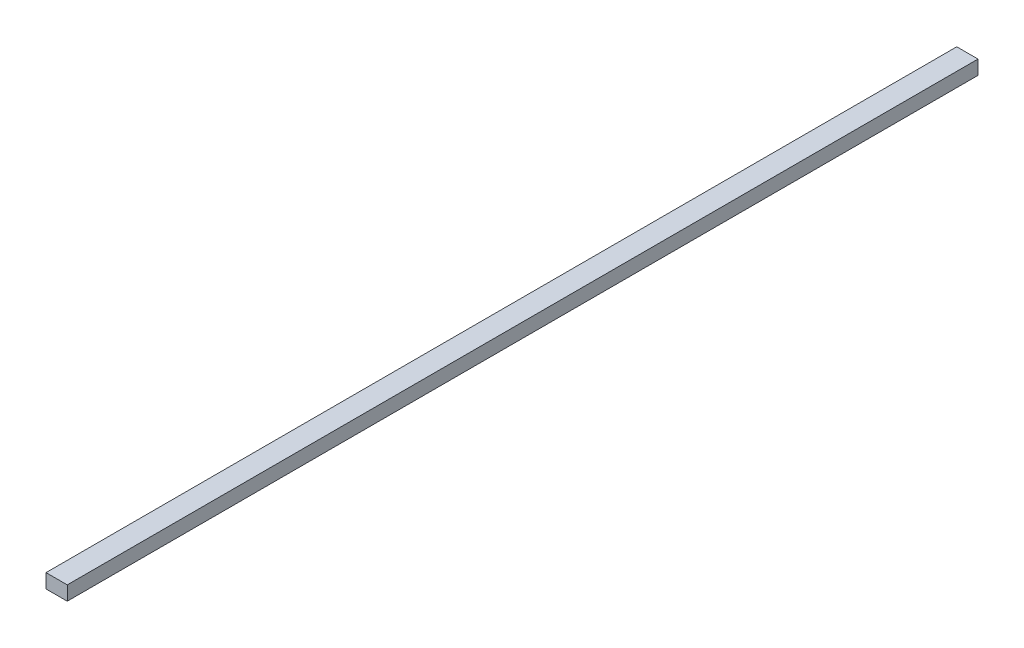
ISO-10303-21;
HEADER;
FILE_DESCRIPTION(('STEP AP214'),'2;1');
FILE_NAME('part.step','',(''),(''),'','','');
FILE_SCHEMA(('AUTOMOTIVE_DESIGN { 1 0 10303 214 1 1 1 1 }'));
ENDSEC;
DATA;
#1=APPLICATION_CONTEXT('core data for automotive mechanical design processes');
#2=APPLICATION_PROTOCOL_DEFINITION('international standard','automotive_design',2000,#1);
#3=PRODUCT_CONTEXT('',#1,'mechanical');
#4=PRODUCT('Part','Part','',(#3));
#5=PRODUCT_RELATED_PRODUCT_CATEGORY('part','',(#4));
#6=PRODUCT_DEFINITION_FORMATION('','',#4);
#7=PRODUCT_DEFINITION_CONTEXT('part definition',#1,'design');
#8=PRODUCT_DEFINITION('design','',#6,#7);
#9=PRODUCT_DEFINITION_SHAPE('','',#8);
#10=(LENGTH_UNIT() NAMED_UNIT(*) SI_UNIT(.MILLI.,.METRE.));
#11=(NAMED_UNIT(*) PLANE_ANGLE_UNIT() SI_UNIT($,.RADIAN.));
#12=(NAMED_UNIT(*) SI_UNIT($,.STERADIAN.) SOLID_ANGLE_UNIT());
#13=UNCERTAINTY_MEASURE_WITH_UNIT(LENGTH_MEASURE(1.E-05),#10,'distance_accuracy_value','');
#14=(GEOMETRIC_REPRESENTATION_CONTEXT(3) GLOBAL_UNCERTAINTY_ASSIGNED_CONTEXT((#13)) GLOBAL_UNIT_ASSIGNED_CONTEXT((#10,
#11,#12)) REPRESENTATION_CONTEXT('',''));
#15=CARTESIAN_POINT('',(0.,0.,0.));
#16=DIRECTION('',(0.,0.,1.));
#17=DIRECTION('',(1.,0.,0.));
#18=AXIS2_PLACEMENT_3D('',#15,#16,#17);
#19=CARTESIAN_POINT('',(-21.,-14.,1800.));
#20=DIRECTION('',(1.,0.,0.));
#21=DIRECTION('',(0.,0.,-1.));
#22=AXIS2_PLACEMENT_3D('',#19,#20,#21);
#23=PLANE('',#22);
#24=DIRECTION('',(0.,-1.,0.));
#25=VECTOR('',#24,1.);
#26=CARTESIAN_POINT('',(-21.,-14.,0.));
#27=LINE('',#26,#25);
#28=CARTESIAN_POINT('',(-21.,14.,0.));
#29=VERTEX_POINT('',#28);
#30=CARTESIAN_POINT('',(-21.,-14.,0.));
#31=VERTEX_POINT('',#30);
#32=EDGE_CURVE('E96',#29,#31,#27,.T.);
#33=ORIENTED_EDGE('',*,*,#32,.T.);
#34=DIRECTION('',(0.,0.,-1.));
#35=VECTOR('',#34,1.);
#36=CARTESIAN_POINT('',(-21.,-14.,1800.));
#37=LINE('',#36,#35);
#38=CARTESIAN_POINT('',(-21.,-14.,1800.));
#39=VERTEX_POINT('',#38);
#40=EDGE_CURVE('E11',#39,#31,#37,.T.);
#41=ORIENTED_EDGE('',*,*,#40,.F.);
#42=DIRECTION('',(0.,-1.,0.));
#43=VECTOR('',#42,1.);
#44=CARTESIAN_POINT('',(-21.,-14.,1800.));
#45=LINE('',#44,#43);
#46=CARTESIAN_POINT('',(-21.,14.,1800.));
#47=VERTEX_POINT('',#46);
#48=EDGE_CURVE('E84',#47,#39,#45,.T.);
#49=ORIENTED_EDGE('',*,*,#48,.F.);
#50=DIRECTION('',(0.,0.,-1.));
#51=VECTOR('',#50,1.);
#52=CARTESIAN_POINT('',(-21.,14.,1800.));
#53=LINE('',#52,#51);
#54=EDGE_CURVE('E92',#47,#29,#53,.T.);
#55=ORIENTED_EDGE('',*,*,#54,.T.);
#56=EDGE_LOOP('',(#33,#41,#49,#55));
#57=FACE_BOUND('',#56,.T.);
#58=ADVANCED_FACE('F33',(#57),#23,.F.);
#59=CARTESIAN_POINT('',(21.,-14.,1800.));
#60=DIRECTION('',(0.,1.,0.));
#61=DIRECTION('',(-1.,0.,0.));
#62=AXIS2_PLACEMENT_3D('',#59,#60,#61);
#63=PLANE('',#62);
#64=DIRECTION('',(1.,0.,0.));
#65=VECTOR('',#64,1.);
#66=CARTESIAN_POINT('',(21.,-14.,0.));
#67=LINE('',#66,#65);
#68=CARTESIAN_POINT('',(21.,-14.,0.));
#69=VERTEX_POINT('',#68);
#70=EDGE_CURVE('E88',#31,#69,#67,.T.);
#71=ORIENTED_EDGE('',*,*,#70,.T.);
#72=DIRECTION('',(0.,0.,-1.));
#73=VECTOR('',#72,1.);
#74=CARTESIAN_POINT('',(21.,-14.,1800.));
#75=LINE('',#74,#73);
#76=CARTESIAN_POINT('',(21.,-14.,1800.));
#77=VERTEX_POINT('',#76);
#78=EDGE_CURVE('E41',#77,#69,#75,.T.);
#79=ORIENTED_EDGE('',*,*,#78,.F.);
#80=DIRECTION('',(1.,0.,0.));
#81=VECTOR('',#80,1.);
#82=CARTESIAN_POINT('',(21.,-14.,1800.));
#83=LINE('',#82,#81);
#84=EDGE_CURVE('E79',#39,#77,#83,.T.);
#85=ORIENTED_EDGE('',*,*,#84,.F.);
#86=ORIENTED_EDGE('',*,*,#40,.T.);
#87=EDGE_LOOP('',(#71,#79,#85,#86));
#88=FACE_BOUND('',#87,.T.);
#89=ADVANCED_FACE('F87',(#88),#63,.F.);
#90=CARTESIAN_POINT('',(21.,-14.,1800.));
#91=DIRECTION('',(-1.,0.,0.));
#92=DIRECTION('',(0.,0.,1.));
#93=AXIS2_PLACEMENT_3D('',#90,#91,#92);
#94=PLANE('',#93);
#95=DIRECTION('',(0.,1.,0.));
#96=VECTOR('',#95,1.);
#97=CARTESIAN_POINT('',(21.,-14.,0.));
#98=LINE('',#97,#96);
#99=CARTESIAN_POINT('',(21.,14.,0.));
#100=VERTEX_POINT('',#99);
#101=EDGE_CURVE('E66',#69,#100,#98,.T.);
#102=ORIENTED_EDGE('',*,*,#101,.T.);
#103=DIRECTION('',(0.,0.,-1.));
#104=VECTOR('',#103,1.);
#105=CARTESIAN_POINT('',(21.,14.,1800.));
#106=LINE('',#105,#104);
#107=CARTESIAN_POINT('',(21.,14.,1800.));
#108=VERTEX_POINT('',#107);
#109=EDGE_CURVE('E89',#108,#100,#106,.T.);
#110=ORIENTED_EDGE('',*,*,#109,.F.);
#111=DIRECTION('',(0.,1.,0.));
#112=VECTOR('',#111,1.);
#113=CARTESIAN_POINT('',(21.,-14.,1800.));
#114=LINE('',#113,#112);
#115=EDGE_CURVE('E82',#77,#108,#114,.T.);
#116=ORIENTED_EDGE('',*,*,#115,.F.);
#117=ORIENTED_EDGE('',*,*,#78,.T.);
#118=EDGE_LOOP('',(#102,#110,#116,#117));
#119=FACE_BOUND('',#118,.T.);
#120=ADVANCED_FACE('F90',(#119),#94,.F.);
#121=CARTESIAN_POINT('',(21.,14.,1800.));
#122=DIRECTION('',(0.,-1.,0.));
#123=DIRECTION('',(1.,0.,0.));
#124=AXIS2_PLACEMENT_3D('',#121,#122,#123);
#125=PLANE('',#124);
#126=DIRECTION('',(-1.,0.,0.));
#127=VECTOR('',#126,1.);
#128=CARTESIAN_POINT('',(21.,14.,0.));
#129=LINE('',#128,#127);
#130=EDGE_CURVE('E72',#100,#29,#129,.T.);
#131=ORIENTED_EDGE('',*,*,#130,.T.);
#132=ORIENTED_EDGE('',*,*,#54,.F.);
#133=DIRECTION('',(-1.,0.,0.));
#134=VECTOR('',#133,1.);
#135=CARTESIAN_POINT('',(21.,14.,1800.));
#136=LINE('',#135,#134);
#137=EDGE_CURVE('E49',#108,#47,#136,.T.);
#138=ORIENTED_EDGE('',*,*,#137,.F.);
#139=ORIENTED_EDGE('',*,*,#109,.T.);
#140=EDGE_LOOP('',(#131,#132,#138,#139));
#141=FACE_BOUND('',#140,.T.);
#142=ADVANCED_FACE('F103',(#141),#125,.F.);
#143=CARTESIAN_POINT('',(0.,0.,1800.));
#144=DIRECTION('',(0.,0.,1.));
#145=DIRECTION('',(1.,0.,0.));
#146=AXIS2_PLACEMENT_3D('',#143,#144,#145);
#147=PLANE('',#146);
#148=ORIENTED_EDGE('',*,*,#48,.T.);
#149=ORIENTED_EDGE('',*,*,#84,.T.);
#150=ORIENTED_EDGE('',*,*,#115,.T.);
#151=ORIENTED_EDGE('',*,*,#137,.T.);
#152=EDGE_LOOP('',(#148,#149,#150,#151));
#153=FACE_BOUND('',#152,.T.);
#154=ADVANCED_FACE('F80',(#153),#147,.T.);
#155=CARTESIAN_POINT('',(0.,0.,0.));
#156=DIRECTION('',(0.,0.,1.));
#157=DIRECTION('',(1.,0.,0.));
#158=AXIS2_PLACEMENT_3D('',#155,#156,#157);
#159=PLANE('',#158);
#160=ORIENTED_EDGE('',*,*,#32,.F.);
#161=ORIENTED_EDGE('',*,*,#130,.F.);
#162=ORIENTED_EDGE('',*,*,#101,.F.);
#163=ORIENTED_EDGE('',*,*,#70,.F.);
#164=EDGE_LOOP('',(#160,#161,#162,#163));
#165=FACE_BOUND('',#164,.T.);
#166=ADVANCED_FACE('F106',(#165),#159,.F.);
#167=CLOSED_SHELL('',(#58,#89,#120,#142,#154,#166));
#168=MANIFOLD_SOLID_BREP('B2',#167);
#169=ADVANCED_BREP_SHAPE_REPRESENTATION('',(#18,#168),#14);
#170=SHAPE_DEFINITION_REPRESENTATION(#9,#169);
ENDSEC;
END-ISO-10303-21;
